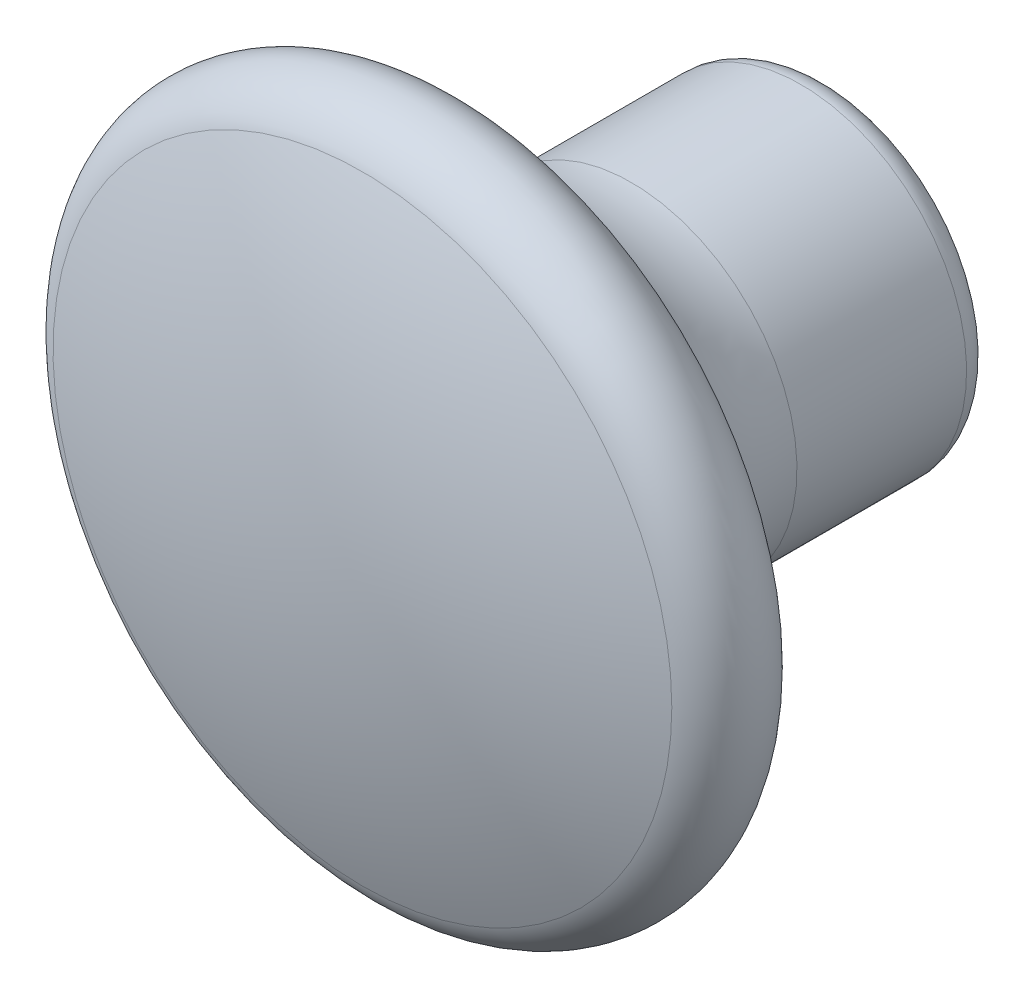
ISO-10303-21;
HEADER;
FILE_DESCRIPTION(('STEP AP214'),'2;1');
FILE_NAME('part.step','',(''),(''),'','','');
FILE_SCHEMA(('AUTOMOTIVE_DESIGN { 1 0 10303 214 1 1 1 1 }'));
ENDSEC;
DATA;
#1=APPLICATION_CONTEXT('core data for automotive mechanical design processes');
#2=APPLICATION_PROTOCOL_DEFINITION('international standard','automotive_design',2000,#1);
#3=PRODUCT_CONTEXT('',#1,'mechanical');
#4=PRODUCT('Part','Part','',(#3));
#5=PRODUCT_RELATED_PRODUCT_CATEGORY('part','',(#4));
#6=PRODUCT_DEFINITION_FORMATION('','',#4);
#7=PRODUCT_DEFINITION_CONTEXT('part definition',#1,'design');
#8=PRODUCT_DEFINITION('design','',#6,#7);
#9=PRODUCT_DEFINITION_SHAPE('','',#8);
#10=(LENGTH_UNIT() NAMED_UNIT(*) SI_UNIT(.MILLI.,.METRE.));
#11=(NAMED_UNIT(*) PLANE_ANGLE_UNIT() SI_UNIT($,.RADIAN.));
#12=(NAMED_UNIT(*) SI_UNIT($,.STERADIAN.) SOLID_ANGLE_UNIT());
#13=UNCERTAINTY_MEASURE_WITH_UNIT(LENGTH_MEASURE(1.E-05),#10,'distance_accuracy_value','');
#14=(GEOMETRIC_REPRESENTATION_CONTEXT(3) GLOBAL_UNCERTAINTY_ASSIGNED_CONTEXT((#13)) GLOBAL_UNIT_ASSIGNED_CONTEXT((#10,
#11,#12)) REPRESENTATION_CONTEXT('',''));
#15=CARTESIAN_POINT('',(0.,0.,0.));
#16=DIRECTION('',(0.,0.,1.));
#17=DIRECTION('',(1.,0.,0.));
#18=AXIS2_PLACEMENT_3D('',#15,#16,#17);
#19=CARTESIAN_POINT('',(0.,0.,-13.1024909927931));
#20=DIRECTION('',(0.,0.,1.));
#21=DIRECTION('',(1.,0.,0.));
#22=AXIS2_PLACEMENT_3D('',#19,#20,#21);
#23=SPHERICAL_SURFACE('',#22,32.);
#24=CARTESIAN_POINT('',(0.,0.,16.873499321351));
#25=DIRECTION('',(0.,0.,1.));
#26=DIRECTION('',(0.,-1.,0.));
#27=AXIS2_PLACEMENT_3D('',#24,#25,#26);
#28=CIRCLE('',#27,11.2000002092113);
#29=CARTESIAN_POINT('',(0.,-11.2000002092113,16.873499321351));
#30=VERTEX_POINT('',#29);
#31=EDGE_CURVE('E31',#30,#30,#28,.T.);
#32=ORIENTED_EDGE('',*,*,#31,.T.);
#33=EDGE_LOOP('',(#32));
#34=FACE_BOUND('',#33,.T.);
#35=ADVANCED_FACE('F12',(#34),#23,.T.);
#36=CARTESIAN_POINT('',(0.,0.,0.));
#37=DIRECTION('',(0.,0.,1.));
#38=DIRECTION('',(0.,-1.,0.));
#39=AXIS2_PLACEMENT_3D('',#36,#37,#38);
#40=PLANE('',#39);
#41=CARTESIAN_POINT('',(0.,0.,0.));
#42=DIRECTION('',(0.,0.,-1.));
#43=DIRECTION('',(0.,1.,0.));
#44=AXIS2_PLACEMENT_3D('',#41,#42,#43);
#45=CIRCLE('',#44,2.75);
#46=CARTESIAN_POINT('',(0.,2.75,0.));
#47=VERTEX_POINT('',#46);
#48=EDGE_CURVE('E40',#47,#47,#45,.T.);
#49=ORIENTED_EDGE('',*,*,#48,.F.);
#50=EDGE_LOOP('',(#49));
#51=FACE_BOUND('',#50,.T.);
#52=CARTESIAN_POINT('',(0.,0.,0.));
#53=DIRECTION('',(0.,0.,1.));
#54=DIRECTION('',(0.,-1.,0.));
#55=AXIS2_PLACEMENT_3D('',#52,#53,#54);
#56=CIRCLE('',#55,5.00000000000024);
#57=CARTESIAN_POINT('',(0.,-5.00000000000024,0.));
#58=VERTEX_POINT('',#57);
#59=EDGE_CURVE('E8',#58,#58,#56,.T.);
#60=ORIENTED_EDGE('',*,*,#59,.F.);
#61=EDGE_LOOP('',(#60));
#62=FACE_BOUND('',#61,.T.);
#63=ADVANCED_FACE('F68',(#51,#62),#40,.F.);
#64=CARTESIAN_POINT('',(0.,0.,1.));
#65=DIRECTION('',(0.,0.,1.));
#66=DIRECTION('',(0.,-1.,0.));
#67=AXIS2_PLACEMENT_3D('',#64,#65,#66);
#68=TOROIDAL_SURFACE('',#67,5.00000000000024,1.);
#69=CARTESIAN_POINT('',(0.,0.,1.));
#70=DIRECTION('',(0.,0.,1.));
#71=DIRECTION('',(0.,-1.,0.));
#72=AXIS2_PLACEMENT_3D('',#69,#70,#71);
#73=CIRCLE('',#72,6.00000000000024);
#74=CARTESIAN_POINT('',(0.,-6.00000000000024,1.));
#75=VERTEX_POINT('',#74);
#76=EDGE_CURVE('E18',#75,#75,#73,.T.);
#77=ORIENTED_EDGE('',*,*,#76,.F.);
#78=EDGE_LOOP('',(#77));
#79=FACE_BOUND('',#78,.T.);
#80=ORIENTED_EDGE('',*,*,#59,.T.);
#81=EDGE_LOOP('',(#80));
#82=FACE_BOUND('',#81,.T.);
#83=ADVANCED_FACE('F71',(#79,#82),#68,.T.);
#84=CARTESIAN_POINT('',(0.,0.,18.8975090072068));
#85=DIRECTION('',(0.,0.,1.));
#86=DIRECTION('',(0.,-1.,0.));
#87=AXIS2_PLACEMENT_3D('',#84,#85,#86);
#88=CYLINDRICAL_SURFACE('',#87,6.00000000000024);
#89=CARTESIAN_POINT('',(0.,0.,7.14188508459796));
#90=DIRECTION('',(0.,0.,1.));
#91=DIRECTION('',(0.,-1.,0.));
#92=AXIS2_PLACEMENT_3D('',#89,#90,#91);
#93=CIRCLE('',#92,6.00000000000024);
#94=CARTESIAN_POINT('',(0.,-6.00000000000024,7.14188508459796));
#95=VERTEX_POINT('',#94);
#96=EDGE_CURVE('E22',#95,#95,#93,.T.);
#97=ORIENTED_EDGE('',*,*,#96,.F.);
#98=EDGE_LOOP('',(#97));
#99=FACE_BOUND('',#98,.T.);
#100=ORIENTED_EDGE('',*,*,#76,.T.);
#101=EDGE_LOOP('',(#100));
#102=FACE_BOUND('',#101,.T.);
#103=ADVANCED_FACE('F78',(#99,#102),#88,.T.);
#104=CARTESIAN_POINT('',(0.,0.,7.14188317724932));
#105=DIRECTION('',(0.,0.,1.));
#106=DIRECTION('',(0.,-1.,0.));
#107=AXIS2_PLACEMENT_3D('',#104,#105,#106);
#108=TOROIDAL_SURFACE('',#107,12.,6.);
#109=CARTESIAN_POINT('',(0.,0.,13.0354707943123));
#110=DIRECTION('',(0.,0.,1.));
#111=DIRECTION('',(0.,-1.,0.));
#112=AXIS2_PLACEMENT_3D('',#109,#110,#111);
#113=CIRCLE('',#112,10.8749999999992);
#114=CARTESIAN_POINT('',(0.,-10.8749999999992,13.0354707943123));
#115=VERTEX_POINT('',#114);
#116=EDGE_CURVE('E26',#115,#115,#113,.T.);
#117=ORIENTED_EDGE('',*,*,#116,.F.);
#118=EDGE_LOOP('',(#117));
#119=FACE_BOUND('',#118,.T.);
#120=ORIENTED_EDGE('',*,*,#96,.T.);
#121=EDGE_LOOP('',(#120));
#122=FACE_BOUND('',#121,.T.);
#123=ADVANCED_FACE('F85',(#119,#122),#108,.F.);
#124=CARTESIAN_POINT('',(0.,0.,15.));
#125=DIRECTION('',(0.,0.,1.));
#126=DIRECTION('',(0.,-1.,0.));
#127=AXIS2_PLACEMENT_3D('',#124,#125,#126);
#128=TOROIDAL_SURFACE('',#127,10.499999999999,2.00000000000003);
#129=ORIENTED_EDGE('',*,*,#31,.F.);
#130=EDGE_LOOP('',(#129));
#131=FACE_BOUND('',#130,.T.);
#132=ORIENTED_EDGE('',*,*,#116,.T.);
#133=EDGE_LOOP('',(#132));
#134=FACE_BOUND('',#133,.T.);
#135=ADVANCED_FACE('F53',(#131,#134),#128,.T.);
#136=CARTESIAN_POINT('',(0.,0.,0.));
#137=DIRECTION('',(0.,0.,-1.));
#138=DIRECTION('',(0.,1.,0.));
#139=AXIS2_PLACEMENT_3D('',#136,#137,#138);
#140=CYLINDRICAL_SURFACE('',#139,2.5);
#141=CARTESIAN_POINT('',(0.,0.,10.));
#142=DIRECTION('',(0.,0.,-1.));
#143=DIRECTION('',(0.,1.,0.));
#144=AXIS2_PLACEMENT_3D('',#141,#142,#143);
#145=CIRCLE('',#144,2.5);
#146=CARTESIAN_POINT('',(0.,2.5,10.));
#147=VERTEX_POINT('',#146);
#148=EDGE_CURVE('E43',#147,#147,#145,.T.);
#149=ORIENTED_EDGE('',*,*,#148,.F.);
#150=EDGE_LOOP('',(#149));
#151=FACE_BOUND('',#150,.T.);
#152=CARTESIAN_POINT('',(0.,0.,3.));
#153=DIRECTION('',(0.,0.,-1.));
#154=DIRECTION('',(0.,1.,0.));
#155=AXIS2_PLACEMENT_3D('',#152,#153,#154);
#156=CIRCLE('',#155,2.5);
#157=CARTESIAN_POINT('',(0.,2.5,3.));
#158=VERTEX_POINT('',#157);
#159=EDGE_CURVE('E34',#158,#158,#156,.T.);
#160=ORIENTED_EDGE('',*,*,#159,.T.);
#161=EDGE_LOOP('',(#160));
#162=FACE_BOUND('',#161,.T.);
#163=ADVANCED_FACE('F49',(#151,#162),#140,.F.);
#164=CARTESIAN_POINT('',(0.,2.5,3.));
#165=DIRECTION('',(0.,0.,1.));
#166=DIRECTION('',(0.,-1.,0.));
#167=AXIS2_PLACEMENT_3D('',#164,#165,#166);
#168=PLANE('',#167);
#169=ORIENTED_EDGE('',*,*,#159,.F.);
#170=EDGE_LOOP('',(#169));
#171=FACE_BOUND('',#170,.T.);
#172=CARTESIAN_POINT('',(0.,0.,3.));
#173=DIRECTION('',(0.,0.,-1.));
#174=DIRECTION('',(0.,1.,0.));
#175=AXIS2_PLACEMENT_3D('',#172,#173,#174);
#176=CIRCLE('',#175,2.75);
#177=CARTESIAN_POINT('',(0.,2.75,3.));
#178=VERTEX_POINT('',#177);
#179=EDGE_CURVE('E37',#178,#178,#176,.T.);
#180=ORIENTED_EDGE('',*,*,#179,.T.);
#181=EDGE_LOOP('',(#180));
#182=FACE_BOUND('',#181,.T.);
#183=ADVANCED_FACE('F52',(#171,#182),#168,.F.);
#184=CARTESIAN_POINT('',(0.,0.,0.));
#185=DIRECTION('',(0.,0.,-1.));
#186=DIRECTION('',(0.,1.,0.));
#187=AXIS2_PLACEMENT_3D('',#184,#185,#186);
#188=CYLINDRICAL_SURFACE('',#187,2.75);
#189=ORIENTED_EDGE('',*,*,#179,.F.);
#190=EDGE_LOOP('',(#189));
#191=FACE_BOUND('',#190,.T.);
#192=ORIENTED_EDGE('',*,*,#48,.T.);
#193=EDGE_LOOP('',(#192));
#194=FACE_BOUND('',#193,.T.);
#195=ADVANCED_FACE('F59',(#191,#194),#188,.F.);
#196=CARTESIAN_POINT('',(0.,2.5,10.));
#197=DIRECTION('',(0.,0.,1.));
#198=DIRECTION('',(0.,-1.,0.));
#199=AXIS2_PLACEMENT_3D('',#196,#197,#198);
#200=PLANE('',#199);
#201=ORIENTED_EDGE('',*,*,#148,.T.);
#202=EDGE_LOOP('',(#201));
#203=FACE_BOUND('',#202,.T.);
#204=ADVANCED_FACE('F47',(#203),#200,.F.);
#205=CLOSED_SHELL('',(#35,#63,#83,#103,#123,#135,#163,#183,#195,#204));
#206=MANIFOLD_SOLID_BREP('B1',#205);
#207=ADVANCED_BREP_SHAPE_REPRESENTATION('',(#18,#206),#14);
#208=SHAPE_DEFINITION_REPRESENTATION(#9,#207);
ENDSEC;
END-ISO-10303-21;
